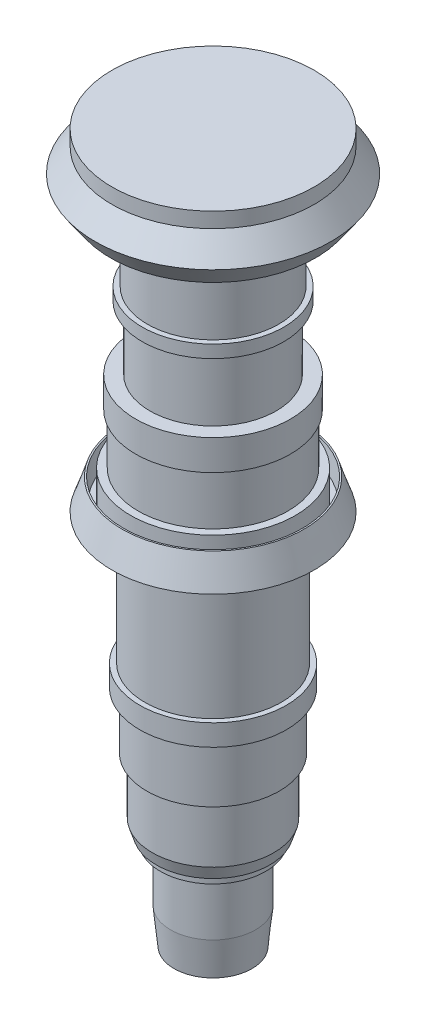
ISO-10303-21;
HEADER;
FILE_DESCRIPTION(('STEP AP214'),'2;1');
FILE_NAME('part.step','',(''),(''),'','','');
FILE_SCHEMA(('AUTOMOTIVE_DESIGN { 1 0 10303 214 1 1 1 1 }'));
ENDSEC;
DATA;
#1=APPLICATION_CONTEXT('core data for automotive mechanical design processes');
#2=APPLICATION_PROTOCOL_DEFINITION('international standard','automotive_design',2000,#1);
#3=PRODUCT_CONTEXT('',#1,'mechanical');
#4=PRODUCT('Part','Part','',(#3));
#5=PRODUCT_RELATED_PRODUCT_CATEGORY('part','',(#4));
#6=PRODUCT_DEFINITION_FORMATION('','',#4);
#7=PRODUCT_DEFINITION_CONTEXT('part definition',#1,'design');
#8=PRODUCT_DEFINITION('design','',#6,#7);
#9=PRODUCT_DEFINITION_SHAPE('','',#8);
#10=(LENGTH_UNIT() NAMED_UNIT(*) SI_UNIT(.MILLI.,.METRE.));
#11=(NAMED_UNIT(*) PLANE_ANGLE_UNIT() SI_UNIT($,.RADIAN.));
#12=(NAMED_UNIT(*) SI_UNIT($,.STERADIAN.) SOLID_ANGLE_UNIT());
#13=UNCERTAINTY_MEASURE_WITH_UNIT(LENGTH_MEASURE(1.E-05),#10,'distance_accuracy_value','');
#14=(GEOMETRIC_REPRESENTATION_CONTEXT(3) GLOBAL_UNCERTAINTY_ASSIGNED_CONTEXT((#13)) GLOBAL_UNIT_ASSIGNED_CONTEXT((#10,
#11,#12)) REPRESENTATION_CONTEXT('',''));
#15=CARTESIAN_POINT('',(0.,0.,0.));
#16=DIRECTION('',(0.,0.,1.));
#17=DIRECTION('',(1.,0.,0.));
#18=AXIS2_PLACEMENT_3D('',#15,#16,#17);
#19=CARTESIAN_POINT('',(77.,0.,0.));
#20=DIRECTION('',(0.,-1.,0.));
#21=DIRECTION('',(0.,0.,-1.));
#22=AXIS2_PLACEMENT_3D('',#19,#20,#21);
#23=PLANE('',#22);
#24=CARTESIAN_POINT('',(0.,0.,0.));
#25=DIRECTION('',(0.,-1.,0.));
#26=DIRECTION('',(0.,0.,-1.));
#27=AXIS2_PLACEMENT_3D('',#24,#25,#26);
#28=CIRCLE('',#27,70.);
#29=CARTESIAN_POINT('',(0.,0.,-70.));
#30=VERTEX_POINT('',#29);
#31=EDGE_CURVE('E165',#30,#30,#28,.T.);
#32=ORIENTED_EDGE('',*,*,#31,.F.);
#33=EDGE_LOOP('',(#32));
#34=FACE_BOUND('',#33,.T.);
#35=CARTESIAN_POINT('',(0.,0.,0.));
#36=DIRECTION('',(0.,-1.,0.));
#37=DIRECTION('',(0.,0.,-1.));
#38=AXIS2_PLACEMENT_3D('',#35,#36,#37);
#39=CIRCLE('',#38,77.);
#40=CARTESIAN_POINT('',(0.,0.,-77.));
#41=VERTEX_POINT('',#40);
#42=EDGE_CURVE('E161',#41,#41,#39,.T.);
#43=ORIENTED_EDGE('',*,*,#42,.T.);
#44=EDGE_LOOP('',(#43));
#45=FACE_BOUND('',#44,.T.);
#46=ADVANCED_FACE('F37',(#34,#45),#23,.T.);
#47=CARTESIAN_POINT('',(0.,1400.,0.));
#48=DIRECTION('',(0.,1.,0.));
#49=DIRECTION('',(0.,0.,1.));
#50=AXIS2_PLACEMENT_3D('',#47,#48,#49);
#51=PLANE('',#50);
#52=CARTESIAN_POINT('',(0.,1400.,0.));
#53=DIRECTION('',(0.,-1.,0.));
#54=DIRECTION('',(0.,0.,-1.));
#55=AXIS2_PLACEMENT_3D('',#52,#53,#54);
#56=CIRCLE('',#55,200.);
#57=CARTESIAN_POINT('',(0.,1400.,-200.));
#58=VERTEX_POINT('',#57);
#59=EDGE_CURVE('E10',#58,#58,#56,.T.);
#60=ORIENTED_EDGE('',*,*,#59,.F.);
#61=EDGE_LOOP('',(#60));
#62=FACE_BOUND('',#61,.T.);
#63=ADVANCED_FACE('F182',(#62),#51,.T.);
#64=CARTESIAN_POINT('',(0.,0.,0.));
#65=DIRECTION('',(0.,-1.,0.));
#66=DIRECTION('',(0.,0.,-1.));
#67=AXIS2_PLACEMENT_3D('',#64,#65,#66);
#68=CYLINDRICAL_SURFACE('',#67,200.);
#69=ORIENTED_EDGE('',*,*,#59,.T.);
#70=EDGE_LOOP('',(#69));
#71=FACE_BOUND('',#70,.T.);
#72=CARTESIAN_POINT('',(0.,1370.,0.));
#73=DIRECTION('',(0.,-1.,0.));
#74=DIRECTION('',(0.,0.,-1.));
#75=AXIS2_PLACEMENT_3D('',#72,#73,#74);
#76=CIRCLE('',#75,200.);
#77=CARTESIAN_POINT('',(0.,1370.,-200.));
#78=VERTEX_POINT('',#77);
#79=EDGE_CURVE('E43',#78,#78,#76,.T.);
#80=ORIENTED_EDGE('',*,*,#79,.F.);
#81=EDGE_LOOP('',(#80));
#82=FACE_BOUND('',#81,.T.);
#83=ADVANCED_FACE('F339',(#71,#82),#68,.T.);
#84=CARTESIAN_POINT('',(0.,1322.87111577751,0.));
#85=DIRECTION('',(0.,-1.,0.));
#86=DIRECTION('',(0.,0.,-1.));
#87=AXIS2_PLACEMENT_3D('',#84,#85,#86);
#88=CONICAL_SURFACE('',#87,233.,0.610865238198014);
#89=ORIENTED_EDGE('',*,*,#79,.T.);
#90=EDGE_LOOP('',(#89));
#91=FACE_BOUND('',#90,.T.);
#92=CARTESIAN_POINT('',(0.,1322.87111577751,0.));
#93=DIRECTION('',(0.,-1.,0.));
#94=DIRECTION('',(0.,0.,-1.));
#95=AXIS2_PLACEMENT_3D('',#92,#93,#94);
#96=CIRCLE('',#95,233.);
#97=CARTESIAN_POINT('',(0.,1322.87111577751,-233.));
#98=VERTEX_POINT('',#97);
#99=EDGE_CURVE('E47',#98,#98,#96,.T.);
#100=ORIENTED_EDGE('',*,*,#99,.F.);
#101=EDGE_LOOP('',(#100));
#102=FACE_BOUND('',#101,.T.);
#103=ADVANCED_FACE('F335',(#91,#102),#88,.T.);
#104=CARTESIAN_POINT('',(0.,1280.,0.));
#105=DIRECTION('',(0.,1.,0.));
#106=DIRECTION('',(0.,0.,1.));
#107=AXIS2_PLACEMENT_3D('',#104,#105,#106);
#108=CONICAL_SURFACE('',#107,202.981321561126,0.610865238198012);
#109=ORIENTED_EDGE('',*,*,#99,.T.);
#110=EDGE_LOOP('',(#109));
#111=FACE_BOUND('',#110,.T.);
#112=CARTESIAN_POINT('',(0.,1280.,0.));
#113=DIRECTION('',(0.,-1.,0.));
#114=DIRECTION('',(0.,0.,-1.));
#115=AXIS2_PLACEMENT_3D('',#112,#113,#114);
#116=CIRCLE('',#115,202.981321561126);
#117=CARTESIAN_POINT('',(0.,1280.,-202.981321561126));
#118=VERTEX_POINT('',#117);
#119=EDGE_CURVE('E51',#118,#118,#116,.T.);
#120=ORIENTED_EDGE('',*,*,#119,.F.);
#121=EDGE_LOOP('',(#120));
#122=FACE_BOUND('',#121,.T.);
#123=ADVANCED_FACE('F331',(#111,#122),#108,.T.);
#124=CARTESIAN_POINT('',(202.981321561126,1280.,0.));
#125=DIRECTION('',(0.,-1.,0.));
#126=DIRECTION('',(0.,0.,-1.));
#127=AXIS2_PLACEMENT_3D('',#124,#125,#126);
#128=PLANE('',#127);
#129=ORIENTED_EDGE('',*,*,#119,.T.);
#130=EDGE_LOOP('',(#129));
#131=FACE_BOUND('',#130,.T.);
#132=CARTESIAN_POINT('',(0.,1280.,0.));
#133=DIRECTION('',(0.,-1.,0.));
#134=DIRECTION('',(0.,0.,-1.));
#135=AXIS2_PLACEMENT_3D('',#132,#133,#134);
#136=CIRCLE('',#135,188.);
#137=CARTESIAN_POINT('',(0.,1280.,-188.));
#138=VERTEX_POINT('',#137);
#139=EDGE_CURVE('E56',#138,#138,#136,.T.);
#140=ORIENTED_EDGE('',*,*,#139,.F.);
#141=EDGE_LOOP('',(#140));
#142=FACE_BOUND('',#141,.T.);
#143=ADVANCED_FACE('F327',(#131,#142),#128,.T.);
#144=CARTESIAN_POINT('',(0.,0.,0.));
#145=DIRECTION('',(0.,-1.,0.));
#146=DIRECTION('',(0.,0.,-1.));
#147=AXIS2_PLACEMENT_3D('',#144,#145,#146);
#148=CYLINDRICAL_SURFACE('',#147,188.);
#149=ORIENTED_EDGE('',*,*,#139,.T.);
#150=EDGE_LOOP('',(#149));
#151=FACE_BOUND('',#150,.T.);
#152=CARTESIAN_POINT('',(0.,1340.,0.));
#153=DIRECTION('',(0.,-1.,0.));
#154=DIRECTION('',(0.,0.,-1.));
#155=AXIS2_PLACEMENT_3D('',#152,#153,#154);
#156=CIRCLE('',#155,188.);
#157=CARTESIAN_POINT('',(0.,1340.,-188.));
#158=VERTEX_POINT('',#157);
#159=EDGE_CURVE('E59',#158,#158,#156,.T.);
#160=ORIENTED_EDGE('',*,*,#159,.F.);
#161=EDGE_LOOP('',(#160));
#162=FACE_BOUND('',#161,.T.);
#163=ADVANCED_FACE('F323',(#151,#162),#148,.F.);
#164=CARTESIAN_POINT('',(188.,1340.,0.));
#165=DIRECTION('',(0.,-1.,0.));
#166=DIRECTION('',(0.,0.,-1.));
#167=AXIS2_PLACEMENT_3D('',#164,#165,#166);
#168=PLANE('',#167);
#169=ORIENTED_EDGE('',*,*,#159,.T.);
#170=EDGE_LOOP('',(#169));
#171=FACE_BOUND('',#170,.T.);
#172=CARTESIAN_POINT('',(0.,1340.,0.));
#173=DIRECTION('',(0.,-1.,0.));
#174=DIRECTION('',(0.,0.,-1.));
#175=AXIS2_PLACEMENT_3D('',#172,#173,#174);
#176=CIRCLE('',#175,146.);
#177=CARTESIAN_POINT('',(0.,1340.,-146.));
#178=VERTEX_POINT('',#177);
#179=EDGE_CURVE('E62',#178,#178,#176,.T.);
#180=ORIENTED_EDGE('',*,*,#179,.F.);
#181=EDGE_LOOP('',(#180));
#182=FACE_BOUND('',#181,.T.);
#183=ADVANCED_FACE('F319',(#171,#182),#168,.T.);
#184=CARTESIAN_POINT('',(0.,0.,0.));
#185=DIRECTION('',(0.,-1.,0.));
#186=DIRECTION('',(0.,0.,-1.));
#187=AXIS2_PLACEMENT_3D('',#184,#185,#186);
#188=CYLINDRICAL_SURFACE('',#187,146.);
#189=ORIENTED_EDGE('',*,*,#179,.T.);
#190=EDGE_LOOP('',(#189));
#191=FACE_BOUND('',#190,.T.);
#192=CARTESIAN_POINT('',(0.,1280.,0.));
#193=DIRECTION('',(0.,-1.,0.));
#194=DIRECTION('',(0.,0.,-1.));
#195=AXIS2_PLACEMENT_3D('',#192,#193,#194);
#196=CIRCLE('',#195,146.);
#197=CARTESIAN_POINT('',(0.,1280.,-146.));
#198=VERTEX_POINT('',#197);
#199=EDGE_CURVE('E65',#198,#198,#196,.T.);
#200=ORIENTED_EDGE('',*,*,#199,.F.);
#201=EDGE_LOOP('',(#200));
#202=FACE_BOUND('',#201,.T.);
#203=ADVANCED_FACE('F315',(#191,#202),#188,.T.);
#204=CARTESIAN_POINT('',(146.,1280.,0.));
#205=DIRECTION('',(0.,-1.,0.));
#206=DIRECTION('',(0.,0.,-1.));
#207=AXIS2_PLACEMENT_3D('',#204,#205,#206);
#208=PLANE('',#207);
#209=ORIENTED_EDGE('',*,*,#199,.T.);
#210=EDGE_LOOP('',(#209));
#211=FACE_BOUND('',#210,.T.);
#212=CARTESIAN_POINT('',(0.,1280.,0.));
#213=DIRECTION('',(0.,-1.,0.));
#214=DIRECTION('',(0.,0.,-1.));
#215=AXIS2_PLACEMENT_3D('',#212,#213,#214);
#216=CIRCLE('',#215,130.);
#217=CARTESIAN_POINT('',(0.,1280.,-130.));
#218=VERTEX_POINT('',#217);
#219=EDGE_CURVE('E68',#218,#218,#216,.T.);
#220=ORIENTED_EDGE('',*,*,#219,.F.);
#221=EDGE_LOOP('',(#220));
#222=FACE_BOUND('',#221,.T.);
#223=ADVANCED_FACE('F311',(#211,#222),#208,.T.);
#224=CARTESIAN_POINT('',(0.,0.,0.));
#225=DIRECTION('',(0.,-1.,0.));
#226=DIRECTION('',(0.,0.,-1.));
#227=AXIS2_PLACEMENT_3D('',#224,#225,#226);
#228=CYLINDRICAL_SURFACE('',#227,130.);
#229=ORIENTED_EDGE('',*,*,#219,.T.);
#230=EDGE_LOOP('',(#229));
#231=FACE_BOUND('',#230,.T.);
#232=CARTESIAN_POINT('',(0.,1130.,0.));
#233=DIRECTION('',(0.,-1.,0.));
#234=DIRECTION('',(0.,0.,-1.));
#235=AXIS2_PLACEMENT_3D('',#232,#233,#234);
#236=CIRCLE('',#235,130.);
#237=CARTESIAN_POINT('',(0.,1130.,-130.));
#238=VERTEX_POINT('',#237);
#239=EDGE_CURVE('E71',#238,#238,#236,.T.);
#240=ORIENTED_EDGE('',*,*,#239,.F.);
#241=EDGE_LOOP('',(#240));
#242=FACE_BOUND('',#241,.T.);
#243=ADVANCED_FACE('F307',(#231,#242),#228,.T.);
#244=CARTESIAN_POINT('',(130.,1130.,0.));
#245=DIRECTION('',(0.,1.,0.));
#246=DIRECTION('',(0.,0.,1.));
#247=AXIS2_PLACEMENT_3D('',#244,#245,#246);
#248=PLANE('',#247);
#249=ORIENTED_EDGE('',*,*,#239,.T.);
#250=EDGE_LOOP('',(#249));
#251=FACE_BOUND('',#250,.T.);
#252=CARTESIAN_POINT('',(0.,1130.,0.));
#253=DIRECTION('',(0.,-1.,0.));
#254=DIRECTION('',(0.,0.,-1.));
#255=AXIS2_PLACEMENT_3D('',#252,#253,#254);
#256=CIRCLE('',#255,140.);
#257=CARTESIAN_POINT('',(0.,1130.,-140.));
#258=VERTEX_POINT('',#257);
#259=EDGE_CURVE('E74',#258,#258,#256,.T.);
#260=ORIENTED_EDGE('',*,*,#259,.F.);
#261=EDGE_LOOP('',(#260));
#262=FACE_BOUND('',#261,.T.);
#263=ADVANCED_FACE('F303',(#251,#262),#248,.T.);
#264=CARTESIAN_POINT('',(0.,0.,0.));
#265=DIRECTION('',(0.,-1.,0.));
#266=DIRECTION('',(0.,0.,-1.));
#267=AXIS2_PLACEMENT_3D('',#264,#265,#266);
#268=CYLINDRICAL_SURFACE('',#267,140.);
#269=ORIENTED_EDGE('',*,*,#259,.T.);
#270=EDGE_LOOP('',(#269));
#271=FACE_BOUND('',#270,.T.);
#272=CARTESIAN_POINT('',(0.,1105.,0.));
#273=DIRECTION('',(0.,-1.,0.));
#274=DIRECTION('',(0.,0.,-1.));
#275=AXIS2_PLACEMENT_3D('',#272,#273,#274);
#276=CIRCLE('',#275,140.);
#277=CARTESIAN_POINT('',(0.,1105.,-140.));
#278=VERTEX_POINT('',#277);
#279=EDGE_CURVE('E77',#278,#278,#276,.T.);
#280=ORIENTED_EDGE('',*,*,#279,.F.);
#281=EDGE_LOOP('',(#280));
#282=FACE_BOUND('',#281,.T.);
#283=ADVANCED_FACE('F299',(#271,#282),#268,.T.);
#284=CARTESIAN_POINT('',(140.,1105.,0.));
#285=DIRECTION('',(0.,-1.,0.));
#286=DIRECTION('',(0.,0.,-1.));
#287=AXIS2_PLACEMENT_3D('',#284,#285,#286);
#288=PLANE('',#287);
#289=ORIENTED_EDGE('',*,*,#279,.T.);
#290=EDGE_LOOP('',(#289));
#291=FACE_BOUND('',#290,.T.);
#292=CARTESIAN_POINT('',(0.,1105.,0.));
#293=DIRECTION('',(0.,-1.,0.));
#294=DIRECTION('',(0.,0.,-1.));
#295=AXIS2_PLACEMENT_3D('',#292,#293,#294);
#296=CIRCLE('',#295,125.);
#297=CARTESIAN_POINT('',(0.,1105.,-125.));
#298=VERTEX_POINT('',#297);
#299=EDGE_CURVE('E80',#298,#298,#296,.T.);
#300=ORIENTED_EDGE('',*,*,#299,.F.);
#301=EDGE_LOOP('',(#300));
#302=FACE_BOUND('',#301,.T.);
#303=ADVANCED_FACE('F295',(#291,#302),#288,.T.);
#304=CARTESIAN_POINT('',(0.,0.,0.));
#305=DIRECTION('',(0.,-1.,0.));
#306=DIRECTION('',(0.,0.,-1.));
#307=AXIS2_PLACEMENT_3D('',#304,#305,#306);
#308=CYLINDRICAL_SURFACE('',#307,125.);
#309=ORIENTED_EDGE('',*,*,#299,.T.);
#310=EDGE_LOOP('',(#309));
#311=FACE_BOUND('',#310,.T.);
#312=CARTESIAN_POINT('',(0.,979.,0.));
#313=DIRECTION('',(0.,-1.,0.));
#314=DIRECTION('',(0.,0.,-1.));
#315=AXIS2_PLACEMENT_3D('',#312,#313,#314);
#316=CIRCLE('',#315,125.);
#317=CARTESIAN_POINT('',(0.,979.,-125.));
#318=VERTEX_POINT('',#317);
#319=EDGE_CURVE('E83',#318,#318,#316,.T.);
#320=ORIENTED_EDGE('',*,*,#319,.F.);
#321=EDGE_LOOP('',(#320));
#322=FACE_BOUND('',#321,.T.);
#323=ADVANCED_FACE('F291',(#311,#322),#308,.T.);
#324=CARTESIAN_POINT('',(125.,979.,0.));
#325=DIRECTION('',(0.,1.,0.));
#326=DIRECTION('',(0.,0.,1.));
#327=AXIS2_PLACEMENT_3D('',#324,#325,#326);
#328=PLANE('',#327);
#329=ORIENTED_EDGE('',*,*,#319,.T.);
#330=EDGE_LOOP('',(#329));
#331=FACE_BOUND('',#330,.T.);
#332=CARTESIAN_POINT('',(0.,979.,0.));
#333=DIRECTION('',(0.,-1.,0.));
#334=DIRECTION('',(0.,0.,-1.));
#335=AXIS2_PLACEMENT_3D('',#332,#333,#334);
#336=CIRCLE('',#335,153.);
#337=CARTESIAN_POINT('',(0.,979.,-153.));
#338=VERTEX_POINT('',#337);
#339=EDGE_CURVE('E86',#338,#338,#336,.T.);
#340=ORIENTED_EDGE('',*,*,#339,.F.);
#341=EDGE_LOOP('',(#340));
#342=FACE_BOUND('',#341,.T.);
#343=ADVANCED_FACE('F287',(#331,#342),#328,.T.);
#344=CARTESIAN_POINT('',(0.,0.,0.));
#345=DIRECTION('',(0.,-1.,0.));
#346=DIRECTION('',(0.,0.,-1.));
#347=AXIS2_PLACEMENT_3D('',#344,#345,#346);
#348=CYLINDRICAL_SURFACE('',#347,153.);
#349=ORIENTED_EDGE('',*,*,#339,.T.);
#350=EDGE_LOOP('',(#349));
#351=FACE_BOUND('',#350,.T.);
#352=CARTESIAN_POINT('',(0.,919.,0.));
#353=DIRECTION('',(0.,-1.,0.));
#354=DIRECTION('',(0.,0.,-1.));
#355=AXIS2_PLACEMENT_3D('',#352,#353,#354);
#356=CIRCLE('',#355,153.);
#357=CARTESIAN_POINT('',(0.,919.,-153.));
#358=VERTEX_POINT('',#357);
#359=EDGE_CURVE('E89',#358,#358,#356,.T.);
#360=ORIENTED_EDGE('',*,*,#359,.F.);
#361=EDGE_LOOP('',(#360));
#362=FACE_BOUND('',#361,.T.);
#363=ADVANCED_FACE('F283',(#351,#362),#348,.T.);
#364=CARTESIAN_POINT('',(153.,919.,0.));
#365=DIRECTION('',(0.,-1.,0.));
#366=DIRECTION('',(0.,0.,-1.));
#367=AXIS2_PLACEMENT_3D('',#364,#365,#366);
#368=PLANE('',#367);
#369=ORIENTED_EDGE('',*,*,#359,.T.);
#370=EDGE_LOOP('',(#369));
#371=FACE_BOUND('',#370,.T.);
#372=CARTESIAN_POINT('',(0.,919.,0.));
#373=DIRECTION('',(0.,-1.,0.));
#374=DIRECTION('',(0.,0.,-1.));
#375=AXIS2_PLACEMENT_3D('',#372,#373,#374);
#376=CIRCLE('',#375,148.);
#377=CARTESIAN_POINT('',(0.,919.,-148.));
#378=VERTEX_POINT('',#377);
#379=EDGE_CURVE('E92',#378,#378,#376,.T.);
#380=ORIENTED_EDGE('',*,*,#379,.F.);
#381=EDGE_LOOP('',(#380));
#382=FACE_BOUND('',#381,.T.);
#383=ADVANCED_FACE('F279',(#371,#382),#368,.T.);
#384=CARTESIAN_POINT('',(0.,0.,0.));
#385=DIRECTION('',(0.,-1.,0.));
#386=DIRECTION('',(0.,0.,-1.));
#387=AXIS2_PLACEMENT_3D('',#384,#385,#386);
#388=CYLINDRICAL_SURFACE('',#387,148.);
#389=ORIENTED_EDGE('',*,*,#379,.T.);
#390=EDGE_LOOP('',(#389));
#391=FACE_BOUND('',#390,.T.);
#392=CARTESIAN_POINT('',(0.,819.,0.));
#393=DIRECTION('',(0.,-1.,0.));
#394=DIRECTION('',(0.,0.,-1.));
#395=AXIS2_PLACEMENT_3D('',#392,#393,#394);
#396=CIRCLE('',#395,148.);
#397=CARTESIAN_POINT('',(0.,819.,-148.));
#398=VERTEX_POINT('',#397);
#399=EDGE_CURVE('E95',#398,#398,#396,.T.);
#400=ORIENTED_EDGE('',*,*,#399,.F.);
#401=EDGE_LOOP('',(#400));
#402=FACE_BOUND('',#401,.T.);
#403=ADVANCED_FACE('F275',(#391,#402),#388,.T.);
#404=CARTESIAN_POINT('',(148.,819.,0.));
#405=DIRECTION('',(0.,1.,0.));
#406=DIRECTION('',(0.,0.,1.));
#407=AXIS2_PLACEMENT_3D('',#404,#405,#406);
#408=PLANE('',#407);
#409=ORIENTED_EDGE('',*,*,#399,.T.);
#410=EDGE_LOOP('',(#409));
#411=FACE_BOUND('',#410,.T.);
#412=CARTESIAN_POINT('',(0.,819.,0.));
#413=DIRECTION('',(0.,-1.,0.));
#414=DIRECTION('',(0.,0.,-1.));
#415=AXIS2_PLACEMENT_3D('',#412,#413,#414);
#416=CIRCLE('',#415,163.);
#417=CARTESIAN_POINT('',(0.,819.,-163.));
#418=VERTEX_POINT('',#417);
#419=EDGE_CURVE('E98',#418,#418,#416,.T.);
#420=ORIENTED_EDGE('',*,*,#419,.F.);
#421=EDGE_LOOP('',(#420));
#422=FACE_BOUND('',#421,.T.);
#423=ADVANCED_FACE('F271',(#411,#422),#408,.T.);
#424=CARTESIAN_POINT('',(0.,0.,0.));
#425=DIRECTION('',(0.,-1.,0.));
#426=DIRECTION('',(0.,0.,-1.));
#427=AXIS2_PLACEMENT_3D('',#424,#425,#426);
#428=CYLINDRICAL_SURFACE('',#427,163.);
#429=ORIENTED_EDGE('',*,*,#419,.T.);
#430=EDGE_LOOP('',(#429));
#431=FACE_BOUND('',#430,.T.);
#432=CARTESIAN_POINT('',(0.,759.,0.));
#433=DIRECTION('',(0.,-1.,0.));
#434=DIRECTION('',(0.,0.,-1.));
#435=AXIS2_PLACEMENT_3D('',#432,#433,#434);
#436=CIRCLE('',#435,163.);
#437=CARTESIAN_POINT('',(0.,759.,-163.));
#438=VERTEX_POINT('',#437);
#439=EDGE_CURVE('E101',#438,#438,#436,.T.);
#440=ORIENTED_EDGE('',*,*,#439,.F.);
#441=EDGE_LOOP('',(#440));
#442=FACE_BOUND('',#441,.T.);
#443=ADVANCED_FACE('F267',(#431,#442),#428,.T.);
#444=CARTESIAN_POINT('',(163.,759.,0.));
#445=DIRECTION('',(0.,1.,0.));
#446=DIRECTION('',(0.,0.,1.));
#447=AXIS2_PLACEMENT_3D('',#444,#445,#446);
#448=PLANE('',#447);
#449=ORIENTED_EDGE('',*,*,#439,.T.);
#450=EDGE_LOOP('',(#449));
#451=FACE_BOUND('',#450,.T.);
#452=CARTESIAN_POINT('',(0.,759.,0.));
#453=DIRECTION('',(0.,-1.,0.));
#454=DIRECTION('',(0.,0.,-1.));
#455=AXIS2_PLACEMENT_3D('',#452,#453,#454);
#456=CIRCLE('',#455,175.);
#457=CARTESIAN_POINT('',(0.,759.,-175.));
#458=VERTEX_POINT('',#457);
#459=EDGE_CURVE('E104',#458,#458,#456,.T.);
#460=ORIENTED_EDGE('',*,*,#459,.F.);
#461=EDGE_LOOP('',(#460));
#462=FACE_BOUND('',#461,.T.);
#463=ADVANCED_FACE('F263',(#451,#462),#448,.T.);
#464=CARTESIAN_POINT('',(0.,804.,0.));
#465=DIRECTION('',(0.,1.,0.));
#466=DIRECTION('',(0.,0.,1.));
#467=AXIS2_PLACEMENT_3D('',#464,#465,#466);
#468=CONICAL_SURFACE('',#467,177.,0.044415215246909);
#469=ORIENTED_EDGE('',*,*,#459,.T.);
#470=EDGE_LOOP('',(#469));
#471=FACE_BOUND('',#470,.T.);
#472=CARTESIAN_POINT('',(0.,804.,0.));
#473=DIRECTION('',(0.,-1.,0.));
#474=DIRECTION('',(0.,0.,-1.));
#475=AXIS2_PLACEMENT_3D('',#472,#473,#474);
#476=CIRCLE('',#475,177.);
#477=CARTESIAN_POINT('',(0.,804.,-177.));
#478=VERTEX_POINT('',#477);
#479=EDGE_CURVE('E107',#478,#478,#476,.T.);
#480=ORIENTED_EDGE('',*,*,#479,.F.);
#481=EDGE_LOOP('',(#480));
#482=FACE_BOUND('',#481,.T.);
#483=ADVANCED_FACE('F259',(#471,#482),#468,.F.);
#484=CARTESIAN_POINT('',(177.,804.,0.));
#485=DIRECTION('',(0.,1.,0.));
#486=DIRECTION('',(0.,0.,1.));
#487=AXIS2_PLACEMENT_3D('',#484,#485,#486);
#488=PLANE('',#487);
#489=ORIENTED_EDGE('',*,*,#479,.T.);
#490=EDGE_LOOP('',(#489));
#491=FACE_BOUND('',#490,.T.);
#492=CARTESIAN_POINT('',(0.,804.,0.));
#493=DIRECTION('',(0.,-1.,0.));
#494=DIRECTION('',(0.,0.,-1.));
#495=AXIS2_PLACEMENT_3D('',#492,#493,#494);
#496=CIRCLE('',#495,180.);
#497=CARTESIAN_POINT('',(0.,804.,-180.));
#498=VERTEX_POINT('',#497);
#499=EDGE_CURVE('E110',#498,#498,#496,.T.);
#500=ORIENTED_EDGE('',*,*,#499,.F.);
#501=EDGE_LOOP('',(#500));
#502=FACE_BOUND('',#501,.T.);
#503=ADVANCED_FACE('F255',(#491,#502),#488,.T.);
#504=CARTESIAN_POINT('',(0.,744.,0.));
#505=DIRECTION('',(0.,-1.,0.));
#506=DIRECTION('',(0.,0.,-1.));
#507=AXIS2_PLACEMENT_3D('',#504,#505,#506);
#508=CONICAL_SURFACE('',#507,200.,0.321750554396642);
#509=ORIENTED_EDGE('',*,*,#499,.T.);
#510=EDGE_LOOP('',(#509));
#511=FACE_BOUND('',#510,.T.);
#512=CARTESIAN_POINT('',(0.,744.,0.));
#513=DIRECTION('',(0.,-1.,0.));
#514=DIRECTION('',(0.,0.,-1.));
#515=AXIS2_PLACEMENT_3D('',#512,#513,#514);
#516=CIRCLE('',#515,200.);
#517=CARTESIAN_POINT('',(0.,744.,-200.));
#518=VERTEX_POINT('',#517);
#519=EDGE_CURVE('E113',#518,#518,#516,.T.);
#520=ORIENTED_EDGE('',*,*,#519,.F.);
#521=EDGE_LOOP('',(#520));
#522=FACE_BOUND('',#521,.T.);
#523=ADVANCED_FACE('F251',(#511,#522),#508,.T.);
#524=CARTESIAN_POINT('',(200.,744.,0.));
#525=DIRECTION('',(0.,-1.,0.));
#526=DIRECTION('',(0.,0.,-1.));
#527=AXIS2_PLACEMENT_3D('',#524,#525,#526);
#528=PLANE('',#527);
#529=ORIENTED_EDGE('',*,*,#519,.T.);
#530=EDGE_LOOP('',(#529));
#531=FACE_BOUND('',#530,.T.);
#532=CARTESIAN_POINT('',(0.,744.,0.));
#533=DIRECTION('',(0.,-1.,0.));
#534=DIRECTION('',(0.,0.,-1.));
#535=AXIS2_PLACEMENT_3D('',#532,#533,#534);
#536=CIRCLE('',#535,197.);
#537=CARTESIAN_POINT('',(0.,744.,-197.));
#538=VERTEX_POINT('',#537);
#539=EDGE_CURVE('E116',#538,#538,#536,.T.);
#540=ORIENTED_EDGE('',*,*,#539,.F.);
#541=EDGE_LOOP('',(#540));
#542=FACE_BOUND('',#541,.T.);
#543=ADVANCED_FACE('F247',(#531,#542),#528,.T.);
#544=CARTESIAN_POINT('',(0.,755.,0.));
#545=DIRECTION('',(0.,-1.,0.));
#546=DIRECTION('',(0.,0.,-1.));
#547=AXIS2_PLACEMENT_3D('',#544,#545,#546);
#548=CONICAL_SURFACE('',#547,191.,0.499346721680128);
#549=ORIENTED_EDGE('',*,*,#539,.T.);
#550=EDGE_LOOP('',(#549));
#551=FACE_BOUND('',#550,.T.);
#552=CARTESIAN_POINT('',(0.,755.,0.));
#553=DIRECTION('',(0.,-1.,0.));
#554=DIRECTION('',(0.,0.,-1.));
#555=AXIS2_PLACEMENT_3D('',#552,#553,#554);
#556=CIRCLE('',#555,191.);
#557=CARTESIAN_POINT('',(0.,755.,-191.));
#558=VERTEX_POINT('',#557);
#559=EDGE_CURVE('E119',#558,#558,#556,.T.);
#560=ORIENTED_EDGE('',*,*,#559,.F.);
#561=EDGE_LOOP('',(#560));
#562=FACE_BOUND('',#561,.T.);
#563=ADVANCED_FACE('F243',(#551,#562),#548,.F.);
#564=CARTESIAN_POINT('',(191.,755.,0.));
#565=DIRECTION('',(0.,-1.,0.));
#566=DIRECTION('',(0.,0.,-1.));
#567=AXIS2_PLACEMENT_3D('',#564,#565,#566);
#568=PLANE('',#567);
#569=ORIENTED_EDGE('',*,*,#559,.T.);
#570=EDGE_LOOP('',(#569));
#571=FACE_BOUND('',#570,.T.);
#572=CARTESIAN_POINT('',(0.,755.,0.));
#573=DIRECTION('',(0.,-1.,0.));
#574=DIRECTION('',(0.,0.,-1.));
#575=AXIS2_PLACEMENT_3D('',#572,#573,#574);
#576=CIRCLE('',#575,135.);
#577=CARTESIAN_POINT('',(0.,755.,-135.));
#578=VERTEX_POINT('',#577);
#579=EDGE_CURVE('E122',#578,#578,#576,.T.);
#580=ORIENTED_EDGE('',*,*,#579,.F.);
#581=EDGE_LOOP('',(#580));
#582=FACE_BOUND('',#581,.T.);
#583=ADVANCED_FACE('F239',(#571,#582),#568,.T.);
#584=CARTESIAN_POINT('',(0.,0.,0.));
#585=DIRECTION('',(0.,-1.,0.));
#586=DIRECTION('',(0.,0.,-1.));
#587=AXIS2_PLACEMENT_3D('',#584,#585,#586);
#588=CYLINDRICAL_SURFACE('',#587,135.);
#589=ORIENTED_EDGE('',*,*,#579,.T.);
#590=EDGE_LOOP('',(#589));
#591=FACE_BOUND('',#590,.T.);
#592=CARTESIAN_POINT('',(0.,485.,0.));
#593=DIRECTION('',(0.,-1.,0.));
#594=DIRECTION('',(0.,0.,-1.));
#595=AXIS2_PLACEMENT_3D('',#592,#593,#594);
#596=CIRCLE('',#595,135.);
#597=CARTESIAN_POINT('',(0.,485.,-135.));
#598=VERTEX_POINT('',#597);
#599=EDGE_CURVE('E125',#598,#598,#596,.T.);
#600=ORIENTED_EDGE('',*,*,#599,.F.);
#601=EDGE_LOOP('',(#600));
#602=FACE_BOUND('',#601,.T.);
#603=ADVANCED_FACE('F235',(#591,#602),#588,.T.);
#604=CARTESIAN_POINT('',(135.,485.,0.));
#605=DIRECTION('',(0.,1.,0.));
#606=DIRECTION('',(0.,0.,1.));
#607=AXIS2_PLACEMENT_3D('',#604,#605,#606);
#608=PLANE('',#607);
#609=ORIENTED_EDGE('',*,*,#599,.T.);
#610=EDGE_LOOP('',(#609));
#611=FACE_BOUND('',#610,.T.);
#612=CARTESIAN_POINT('',(0.,485.,0.));
#613=DIRECTION('',(0.,-1.,0.));
#614=DIRECTION('',(0.,0.,-1.));
#615=AXIS2_PLACEMENT_3D('',#612,#613,#614);
#616=CIRCLE('',#615,145.);
#617=CARTESIAN_POINT('',(0.,485.,-145.));
#618=VERTEX_POINT('',#617);
#619=EDGE_CURVE('E128',#618,#618,#616,.T.);
#620=ORIENTED_EDGE('',*,*,#619,.F.);
#621=EDGE_LOOP('',(#620));
#622=FACE_BOUND('',#621,.T.);
#623=ADVANCED_FACE('F231',(#611,#622),#608,.T.);
#624=CARTESIAN_POINT('',(0.,0.,0.));
#625=DIRECTION('',(0.,-1.,0.));
#626=DIRECTION('',(0.,0.,-1.));
#627=AXIS2_PLACEMENT_3D('',#624,#625,#626);
#628=CYLINDRICAL_SURFACE('',#627,145.);
#629=ORIENTED_EDGE('',*,*,#619,.T.);
#630=EDGE_LOOP('',(#629));
#631=FACE_BOUND('',#630,.T.);
#632=CARTESIAN_POINT('',(0.,443.,0.));
#633=DIRECTION('',(0.,-1.,0.));
#634=DIRECTION('',(0.,0.,-1.));
#635=AXIS2_PLACEMENT_3D('',#632,#633,#634);
#636=CIRCLE('',#635,145.);
#637=CARTESIAN_POINT('',(0.,443.,-145.));
#638=VERTEX_POINT('',#637);
#639=EDGE_CURVE('E131',#638,#638,#636,.T.);
#640=ORIENTED_EDGE('',*,*,#639,.F.);
#641=EDGE_LOOP('',(#640));
#642=FACE_BOUND('',#641,.T.);
#643=ADVANCED_FACE('F227',(#631,#642),#628,.T.);
#644=CARTESIAN_POINT('',(145.,443.,0.));
#645=DIRECTION('',(0.,-1.,0.));
#646=DIRECTION('',(0.,0.,-1.));
#647=AXIS2_PLACEMENT_3D('',#644,#645,#646);
#648=PLANE('',#647);
#649=ORIENTED_EDGE('',*,*,#639,.T.);
#650=EDGE_LOOP('',(#649));
#651=FACE_BOUND('',#650,.T.);
#652=CARTESIAN_POINT('',(0.,443.,0.));
#653=DIRECTION('',(0.,-1.,0.));
#654=DIRECTION('',(0.,0.,-1.));
#655=AXIS2_PLACEMENT_3D('',#652,#653,#654);
#656=CIRCLE('',#655,131.);
#657=CARTESIAN_POINT('',(0.,443.,-131.));
#658=VERTEX_POINT('',#657);
#659=EDGE_CURVE('E134',#658,#658,#656,.T.);
#660=ORIENTED_EDGE('',*,*,#659,.F.);
#661=EDGE_LOOP('',(#660));
#662=FACE_BOUND('',#661,.T.);
#663=ADVANCED_FACE('F223',(#651,#662),#648,.T.);
#664=CARTESIAN_POINT('',(0.,0.,0.));
#665=DIRECTION('',(0.,-1.,0.));
#666=DIRECTION('',(0.,0.,-1.));
#667=AXIS2_PLACEMENT_3D('',#664,#665,#666);
#668=CYLINDRICAL_SURFACE('',#667,131.);
#669=ORIENTED_EDGE('',*,*,#659,.T.);
#670=EDGE_LOOP('',(#669));
#671=FACE_BOUND('',#670,.T.);
#672=CARTESIAN_POINT('',(0.,331.,0.));
#673=DIRECTION('',(0.,-1.,0.));
#674=DIRECTION('',(0.,0.,-1.));
#675=AXIS2_PLACEMENT_3D('',#672,#673,#674);
#676=CIRCLE('',#675,131.);
#677=CARTESIAN_POINT('',(0.,331.,-131.));
#678=VERTEX_POINT('',#677);
#679=EDGE_CURVE('E137',#678,#678,#676,.T.);
#680=ORIENTED_EDGE('',*,*,#679,.F.);
#681=EDGE_LOOP('',(#680));
#682=FACE_BOUND('',#681,.T.);
#683=ADVANCED_FACE('F219',(#671,#682),#668,.T.);
#684=CARTESIAN_POINT('',(131.,331.,0.));
#685=DIRECTION('',(0.,-1.,0.));
#686=DIRECTION('',(0.,0.,-1.));
#687=AXIS2_PLACEMENT_3D('',#684,#685,#686);
#688=PLANE('',#687);
#689=ORIENTED_EDGE('',*,*,#679,.T.);
#690=EDGE_LOOP('',(#689));
#691=FACE_BOUND('',#690,.T.);
#692=CARTESIAN_POINT('',(0.,331.,0.));
#693=DIRECTION('',(0.,-1.,0.));
#694=DIRECTION('',(0.,0.,-1.));
#695=AXIS2_PLACEMENT_3D('',#692,#693,#694);
#696=CIRCLE('',#695,120.);
#697=CARTESIAN_POINT('',(0.,331.,-120.));
#698=VERTEX_POINT('',#697);
#699=EDGE_CURVE('E140',#698,#698,#696,.T.);
#700=ORIENTED_EDGE('',*,*,#699,.F.);
#701=EDGE_LOOP('',(#700));
#702=FACE_BOUND('',#701,.T.);
#703=ADVANCED_FACE('F215',(#691,#702),#688,.T.);
#704=CARTESIAN_POINT('',(0.,0.,0.));
#705=DIRECTION('',(0.,-1.,0.));
#706=DIRECTION('',(0.,0.,-1.));
#707=AXIS2_PLACEMENT_3D('',#704,#705,#706);
#708=CYLINDRICAL_SURFACE('',#707,120.);
#709=ORIENTED_EDGE('',*,*,#699,.T.);
#710=EDGE_LOOP('',(#709));
#711=FACE_BOUND('',#710,.T.);
#712=CARTESIAN_POINT('',(0.,220.,0.));
#713=DIRECTION('',(0.,-1.,0.));
#714=DIRECTION('',(0.,0.,-1.));
#715=AXIS2_PLACEMENT_3D('',#712,#713,#714);
#716=CIRCLE('',#715,120.);
#717=CARTESIAN_POINT('',(0.,220.,-120.));
#718=VERTEX_POINT('',#717);
#719=EDGE_CURVE('E143',#718,#718,#716,.T.);
#720=ORIENTED_EDGE('',*,*,#719,.F.);
#721=EDGE_LOOP('',(#720));
#722=FACE_BOUND('',#721,.T.);
#723=ADVANCED_FACE('F211',(#711,#722),#708,.T.);
#724=CARTESIAN_POINT('',(0.,195.,0.));
#725=DIRECTION('',(0.,1.,0.));
#726=DIRECTION('',(0.,0.,1.));
#727=AXIS2_PLACEMENT_3D('',#724,#725,#726);
#728=CONICAL_SURFACE('',#727,112.,0.309702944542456);
#729=ORIENTED_EDGE('',*,*,#719,.T.);
#730=EDGE_LOOP('',(#729));
#731=FACE_BOUND('',#730,.T.);
#732=CARTESIAN_POINT('',(0.,195.,0.));
#733=DIRECTION('',(0.,-1.,0.));
#734=DIRECTION('',(0.,0.,-1.));
#735=AXIS2_PLACEMENT_3D('',#732,#733,#734);
#736=CIRCLE('',#735,112.);
#737=CARTESIAN_POINT('',(0.,195.,-112.));
#738=VERTEX_POINT('',#737);
#739=EDGE_CURVE('E146',#738,#738,#736,.T.);
#740=ORIENTED_EDGE('',*,*,#739,.F.);
#741=EDGE_LOOP('',(#740));
#742=FACE_BOUND('',#741,.T.);
#743=ADVANCED_FACE('F207',(#731,#742),#728,.T.);
#744=CARTESIAN_POINT('',(104.,195.,0.));
#745=DIRECTION('',(0.,-1.,0.));
#746=DIRECTION('',(0.,0.,-1.));
#747=AXIS2_PLACEMENT_3D('',#744,#745,#746);
#748=PLANE('',#747);
#749=ORIENTED_EDGE('',*,*,#739,.T.);
#750=EDGE_LOOP('',(#749));
#751=FACE_BOUND('',#750,.T.);
#752=CARTESIAN_POINT('',(0.,195.,0.));
#753=DIRECTION('',(0.,-1.,0.));
#754=DIRECTION('',(0.,0.,-1.));
#755=AXIS2_PLACEMENT_3D('',#752,#753,#754);
#756=CIRCLE('',#755,104.);
#757=CARTESIAN_POINT('',(0.,195.,-104.));
#758=VERTEX_POINT('',#757);
#759=EDGE_CURVE('E149',#758,#758,#756,.T.);
#760=ORIENTED_EDGE('',*,*,#759,.F.);
#761=EDGE_LOOP('',(#760));
#762=FACE_BOUND('',#761,.T.);
#763=ADVANCED_FACE('F203',(#751,#762),#748,.T.);
#764=CARTESIAN_POINT('',(0.,0.,0.));
#765=DIRECTION('',(0.,-1.,0.));
#766=DIRECTION('',(0.,0.,-1.));
#767=AXIS2_PLACEMENT_3D('',#764,#765,#766);
#768=CYLINDRICAL_SURFACE('',#767,104.);
#769=ORIENTED_EDGE('',*,*,#759,.T.);
#770=EDGE_LOOP('',(#769));
#771=FACE_BOUND('',#770,.T.);
#772=CARTESIAN_POINT('',(0.,180.,0.));
#773=DIRECTION('',(0.,-1.,0.));
#774=DIRECTION('',(0.,0.,-1.));
#775=AXIS2_PLACEMENT_3D('',#772,#773,#774);
#776=CIRCLE('',#775,104.);
#777=CARTESIAN_POINT('',(0.,180.,-104.));
#778=VERTEX_POINT('',#777);
#779=EDGE_CURVE('E152',#778,#778,#776,.T.);
#780=ORIENTED_EDGE('',*,*,#779,.F.);
#781=EDGE_LOOP('',(#780));
#782=FACE_BOUND('',#781,.T.);
#783=ADVANCED_FACE('F199',(#771,#782),#768,.T.);
#784=CARTESIAN_POINT('',(84.,180.,0.));
#785=DIRECTION('',(0.,-1.,0.));
#786=DIRECTION('',(0.,0.,-1.));
#787=AXIS2_PLACEMENT_3D('',#784,#785,#786);
#788=PLANE('',#787);
#789=ORIENTED_EDGE('',*,*,#779,.T.);
#790=EDGE_LOOP('',(#789));
#791=FACE_BOUND('',#790,.T.);
#792=CARTESIAN_POINT('',(0.,180.,0.));
#793=DIRECTION('',(0.,-1.,0.));
#794=DIRECTION('',(0.,0.,-1.));
#795=AXIS2_PLACEMENT_3D('',#792,#793,#794);
#796=CIRCLE('',#795,84.);
#797=CARTESIAN_POINT('',(0.,180.,-84.));
#798=VERTEX_POINT('',#797);
#799=EDGE_CURVE('E155',#798,#798,#796,.T.);
#800=ORIENTED_EDGE('',*,*,#799,.F.);
#801=EDGE_LOOP('',(#800));
#802=FACE_BOUND('',#801,.T.);
#803=ADVANCED_FACE('F192',(#791,#802),#788,.T.);
#804=CARTESIAN_POINT('',(0.,0.,0.));
#805=DIRECTION('',(0.,-1.,0.));
#806=DIRECTION('',(0.,0.,-1.));
#807=AXIS2_PLACEMENT_3D('',#804,#805,#806);
#808=CYLINDRICAL_SURFACE('',#807,84.);
#809=ORIENTED_EDGE('',*,*,#799,.T.);
#810=EDGE_LOOP('',(#809));
#811=FACE_BOUND('',#810,.T.);
#812=CARTESIAN_POINT('',(0.,70.,0.));
#813=DIRECTION('',(0.,-1.,0.));
#814=DIRECTION('',(0.,0.,-1.));
#815=AXIS2_PLACEMENT_3D('',#812,#813,#814);
#816=CIRCLE('',#815,84.);
#817=CARTESIAN_POINT('',(0.,70.,-84.));
#818=VERTEX_POINT('',#817);
#819=EDGE_CURVE('E158',#818,#818,#816,.T.);
#820=ORIENTED_EDGE('',*,*,#819,.F.);
#821=EDGE_LOOP('',(#820));
#822=FACE_BOUND('',#821,.T.);
#823=ADVANCED_FACE('F186',(#811,#822),#808,.T.);
#824=CARTESIAN_POINT('',(0.,0.,0.));
#825=DIRECTION('',(0.,1.,0.));
#826=DIRECTION('',(0.,0.,1.));
#827=AXIS2_PLACEMENT_3D('',#824,#825,#826);
#828=CONICAL_SURFACE('',#827,77.,0.0996686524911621);
#829=ORIENTED_EDGE('',*,*,#819,.T.);
#830=EDGE_LOOP('',(#829));
#831=FACE_BOUND('',#830,.T.);
#832=ORIENTED_EDGE('',*,*,#42,.F.);
#833=EDGE_LOOP('',(#832));
#834=FACE_BOUND('',#833,.T.);
#835=ADVANCED_FACE('F176',(#831,#834),#828,.T.);
#836=CARTESIAN_POINT('',(0.,420.,0.));
#837=DIRECTION('',(0.,-1.,0.));
#838=DIRECTION('',(0.,0.,-1.));
#839=AXIS2_PLACEMENT_3D('',#836,#837,#838);
#840=CYLINDRICAL_SURFACE('',#839,70.);
#841=CARTESIAN_POINT('',(0.,420.,0.));
#842=DIRECTION('',(0.,-1.,0.));
#843=DIRECTION('',(0.,0.,-1.));
#844=AXIS2_PLACEMENT_3D('',#841,#842,#843);
#845=CIRCLE('',#844,70.);
#846=CARTESIAN_POINT('',(0.,420.,-70.));
#847=VERTEX_POINT('',#846);
#848=EDGE_CURVE('E164',#847,#847,#845,.T.);
#849=CARTESIAN_POINT('',(0.,420.,-70.));
#850=CARTESIAN_POINT('',(0.,415.625,-70.));
#851=CARTESIAN_POINT('',(0.,411.25,-70.));
#852=CARTESIAN_POINT('',(0.,402.5,-70.));
#853=CARTESIAN_POINT('',(0.,398.125,-70.));
#854=CARTESIAN_POINT('',(0.,389.375,-70.));
#855=CARTESIAN_POINT('',(0.,385.,-70.));
#856=CARTESIAN_POINT('',(0.,376.25,-70.));
#857=CARTESIAN_POINT('',(0.,371.875,-70.));
#858=CARTESIAN_POINT('',(0.,363.125,-70.));
#859=CARTESIAN_POINT('',(0.,358.75,-70.));
#860=CARTESIAN_POINT('',(0.,350.,-70.));
#861=CARTESIAN_POINT('',(0.,345.625,-70.));
#862=CARTESIAN_POINT('',(0.,336.875,-70.));
#863=CARTESIAN_POINT('',(0.,332.5,-70.));
#864=CARTESIAN_POINT('',(0.,323.75,-70.));
#865=CARTESIAN_POINT('',(0.,319.375,-70.));
#866=CARTESIAN_POINT('',(0.,310.625,-70.));
#867=CARTESIAN_POINT('',(0.,306.25,-70.));
#868=CARTESIAN_POINT('',(0.,297.5,-70.));
#869=CARTESIAN_POINT('',(0.,293.125,-70.));
#870=CARTESIAN_POINT('',(0.,284.375,-70.));
#871=CARTESIAN_POINT('',(0.,280.,-70.));
#872=CARTESIAN_POINT('',(0.,271.25,-70.));
#873=CARTESIAN_POINT('',(0.,266.875,-70.));
#874=CARTESIAN_POINT('',(0.,258.125,-70.));
#875=CARTESIAN_POINT('',(0.,253.75,-70.));
#876=CARTESIAN_POINT('',(0.,245.,-70.));
#877=CARTESIAN_POINT('',(0.,240.625,-70.));
#878=CARTESIAN_POINT('',(0.,231.875,-70.));
#879=CARTESIAN_POINT('',(0.,227.5,-70.));
#880=CARTESIAN_POINT('',(0.,218.75,-70.));
#881=CARTESIAN_POINT('',(0.,214.375,-70.));
#882=CARTESIAN_POINT('',(0.,205.625,-70.));
#883=CARTESIAN_POINT('',(0.,201.25,-70.));
#884=CARTESIAN_POINT('',(0.,192.5,-70.));
#885=CARTESIAN_POINT('',(0.,188.125,-70.));
#886=CARTESIAN_POINT('',(0.,179.375,-70.));
#887=CARTESIAN_POINT('',(0.,175.,-70.));
#888=CARTESIAN_POINT('',(0.,166.25,-70.));
#889=CARTESIAN_POINT('',(0.,161.875,-70.));
#890=CARTESIAN_POINT('',(0.,153.125,-70.));
#891=CARTESIAN_POINT('',(0.,148.75,-70.));
#892=CARTESIAN_POINT('',(0.,140.,-70.));
#893=CARTESIAN_POINT('',(0.,135.625,-70.));
#894=CARTESIAN_POINT('',(0.,126.875,-70.));
#895=CARTESIAN_POINT('',(0.,122.5,-70.));
#896=CARTESIAN_POINT('',(0.,113.75,-70.));
#897=CARTESIAN_POINT('',(0.,109.375,-70.));
#898=CARTESIAN_POINT('',(0.,100.625,-70.));
#899=CARTESIAN_POINT('',(0.,96.2500000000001,-70.));
#900=CARTESIAN_POINT('',(0.,87.5000000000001,-70.));
#901=CARTESIAN_POINT('',(0.,83.1250000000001,-70.));
#902=CARTESIAN_POINT('',(0.,74.375,-70.));
#903=CARTESIAN_POINT('',(0.,70.,-70.));
#904=CARTESIAN_POINT('',(0.,61.25,-70.));
#905=CARTESIAN_POINT('',(0.,56.875,-70.));
#906=CARTESIAN_POINT('',(0.,48.125,-70.));
#907=CARTESIAN_POINT('',(0.,43.75,-70.));
#908=CARTESIAN_POINT('',(0.,35.,-70.));
#909=CARTESIAN_POINT('',(0.,30.625,-70.));
#910=CARTESIAN_POINT('',(0.,21.875,-70.));
#911=CARTESIAN_POINT('',(0.,17.5,-70.));
#912=CARTESIAN_POINT('',(0.,8.75,-70.));
#913=CARTESIAN_POINT('',(0.,4.375,-70.));
#914=CARTESIAN_POINT('',(0.,0.,-70.));
#915=B_SPLINE_CURVE_WITH_KNOTS('',3,(#849,#850,#851,#852,#853,#854,#855,#856,#857,#858,#859,
#860,#861,#862,#863,#864,#865,#866,#867,#868,#869,#870,#871,#872,#873,#874,#875,#876,#877,#878,
#879,#880,#881,#882,#883,#884,#885,#886,#887,#888,#889,#890,#891,#892,#893,#894,#895,#896,#897,
#898,#899,#900,#901,#902,#903,#904,#905,#906,#907,#908,#909,#910,#911,#912,#913,#914),
.UNSPECIFIED.,.F.,.F.,(4,2,2,2,2,2,2,2,2,2,2,2,2,2,2,2,2,2,2,2,2,2,2,2,2,2,2,2,2,2,2,2,4),(0.,
13.1250000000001,26.25,39.375,52.5,65.625,78.7500000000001,91.8750000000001,105.,118.125,131.25,
144.375,157.5,170.625,183.75,196.875,210.,223.125,236.25,249.375,262.5,275.625,288.75,301.875,
315.,328.125,341.25,354.375,367.5,380.625,393.75,406.875,420.),.UNSPECIFIED.);
#916=EDGE_CURVE('BSEAM173',#847,#30,#915,.T.);
#917=ORIENTED_EDGE('',*,*,#848,.F.);
#918=ORIENTED_EDGE('',*,*,#31,.T.);
#919=ORIENTED_EDGE('',*,*,#916,.T.);
#920=ORIENTED_EDGE('',*,*,#916,.F.);
#921=EDGE_LOOP('',(#917,#919,#918,#920));
#922=FACE_BOUND('',#921,.T.);
#923=ADVANCED_FACE('F173',(#922),#840,.F.);
#924=CARTESIAN_POINT('',(0.,420.,0.));
#925=DIRECTION('',(0.,-1.,0.));
#926=DIRECTION('',(0.,0.,-1.));
#927=AXIS2_PLACEMENT_3D('',#924,#925,#926);
#928=PLANE('',#927);
#929=ORIENTED_EDGE('',*,*,#848,.T.);
#930=EDGE_LOOP('',(#929));
#931=FACE_BOUND('',#930,.T.);
#932=ADVANCED_FACE('F171',(#931),#928,.T.);
#933=CLOSED_SHELL('',(#46,#63,#83,#103,#123,#143,#163,#183,#203,#223,#243,#263,#283,#303,#323,
#343,#363,#383,#403,#423,#443,#463,#483,#503,#523,#543,#563,#583,#603,#623,#643,#663,#683,#703,
#723,#743,#763,#783,#803,#823,#835,#923,#932));
#934=MANIFOLD_SOLID_BREP('B2',#933);
#935=ADVANCED_BREP_SHAPE_REPRESENTATION('',(#18,#934),#14);
#936=SHAPE_DEFINITION_REPRESENTATION(#9,#935);
ENDSEC;
END-ISO-10303-21;
